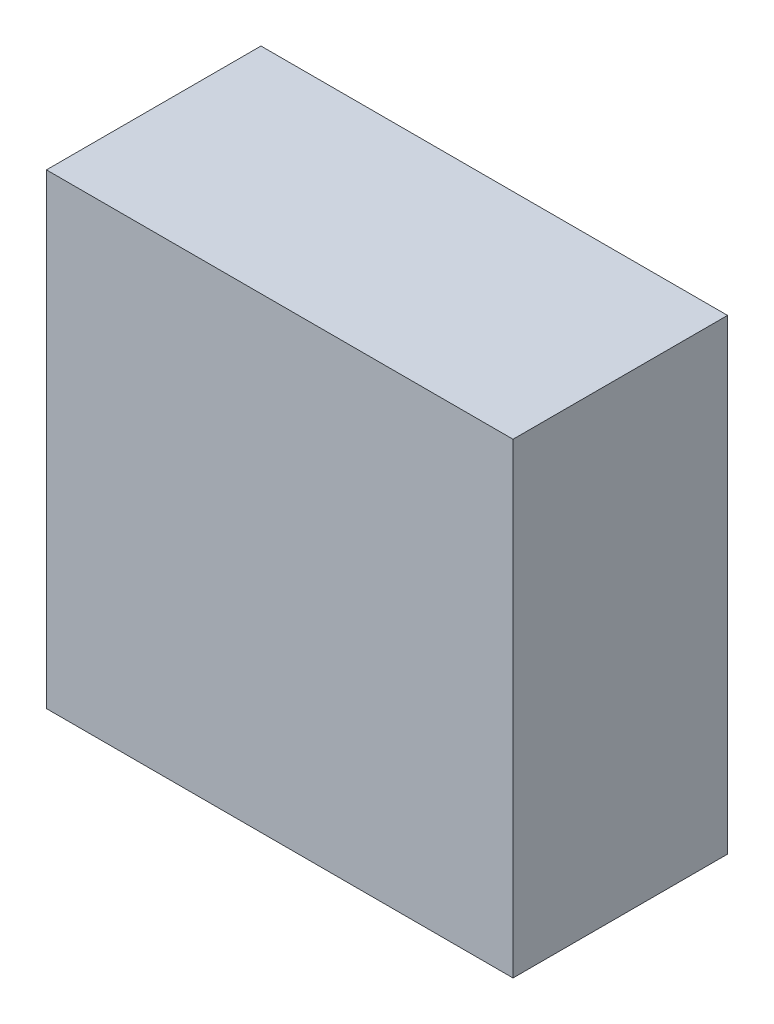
ISO-10303-21;
HEADER;
FILE_DESCRIPTION(('STEP AP214'),'2;1');
FILE_NAME('part.step','',(''),(''),'','','');
FILE_SCHEMA(('AUTOMOTIVE_DESIGN { 1 0 10303 214 1 1 1 1 }'));
ENDSEC;
DATA;
#1=APPLICATION_CONTEXT('core data for automotive mechanical design processes');
#2=APPLICATION_PROTOCOL_DEFINITION('international standard','automotive_design',2000,#1);
#3=PRODUCT_CONTEXT('',#1,'mechanical');
#4=PRODUCT('Part','Part','',(#3));
#5=PRODUCT_RELATED_PRODUCT_CATEGORY('part','',(#4));
#6=PRODUCT_DEFINITION_FORMATION('','',#4);
#7=PRODUCT_DEFINITION_CONTEXT('part definition',#1,'design');
#8=PRODUCT_DEFINITION('design','',#6,#7);
#9=PRODUCT_DEFINITION_SHAPE('','',#8);
#10=(LENGTH_UNIT() NAMED_UNIT(*) SI_UNIT(.MILLI.,.METRE.));
#11=(NAMED_UNIT(*) PLANE_ANGLE_UNIT() SI_UNIT($,.RADIAN.));
#12=(NAMED_UNIT(*) SI_UNIT($,.STERADIAN.) SOLID_ANGLE_UNIT());
#13=UNCERTAINTY_MEASURE_WITH_UNIT(LENGTH_MEASURE(1.E-05),#10,'distance_accuracy_value','');
#14=(GEOMETRIC_REPRESENTATION_CONTEXT(3) GLOBAL_UNCERTAINTY_ASSIGNED_CONTEXT((#13)) GLOBAL_UNIT_ASSIGNED_CONTEXT((#10,
#11,#12)) REPRESENTATION_CONTEXT('',''));
#15=CARTESIAN_POINT('',(0.,0.,0.));
#16=DIRECTION('',(0.,0.,1.));
#17=DIRECTION('',(1.,0.,0.));
#18=AXIS2_PLACEMENT_3D('',#15,#16,#17);
#19=CARTESIAN_POINT('',(-4.34999892,-4.34999892,4.));
#20=DIRECTION('',(0.,0.,1.));
#21=DIRECTION('',(1.,0.,0.));
#22=AXIS2_PLACEMENT_3D('',#19,#20,#21);
#23=PLANE('',#22);
#24=DIRECTION('',(1.,0.,0.));
#25=VECTOR('',#24,1.);
#26=CARTESIAN_POINT('',(-4.34999892,4.35000146,4.));
#27=LINE('',#26,#25);
#28=CARTESIAN_POINT('',(-4.34999892,4.35000146,4.));
#29=VERTEX_POINT('',#28);
#30=CARTESIAN_POINT('',(4.35000146,4.35000146,4.));
#31=VERTEX_POINT('',#30);
#32=EDGE_CURVE('E53',#29,#31,#27,.T.);
#33=ORIENTED_EDGE('',*,*,#32,.F.);
#34=DIRECTION('',(0.,1.,0.));
#35=VECTOR('',#34,1.);
#36=CARTESIAN_POINT('',(-4.34999892,-4.34999892,4.));
#37=LINE('',#36,#35);
#38=CARTESIAN_POINT('',(-4.34999892,-4.34999892,4.));
#39=VERTEX_POINT('',#38);
#40=EDGE_CURVE('E68',#39,#29,#37,.T.);
#41=ORIENTED_EDGE('',*,*,#40,.F.);
#42=DIRECTION('',(1.,0.,0.));
#43=VECTOR('',#42,1.);
#44=CARTESIAN_POINT('',(4.35000146,-4.34999892,4.));
#45=LINE('',#44,#43);
#46=CARTESIAN_POINT('',(4.35000146,-4.34999892,4.));
#47=VERTEX_POINT('',#46);
#48=EDGE_CURVE('E20',#47,#39,#45,.F.);
#49=ORIENTED_EDGE('',*,*,#48,.F.);
#50=DIRECTION('',(0.,1.,0.));
#51=VECTOR('',#50,1.);
#52=CARTESIAN_POINT('',(4.35000146,4.35000146,4.));
#53=LINE('',#52,#51);
#54=EDGE_CURVE('E58',#31,#47,#53,.F.);
#55=ORIENTED_EDGE('',*,*,#54,.F.);
#56=EDGE_LOOP('',(#33,#41,#49,#55));
#57=FACE_BOUND('',#56,.T.);
#58=ADVANCED_FACE('F17',(#57),#23,.T.);
#59=CARTESIAN_POINT('',(4.35000146,-4.34999892,0.));
#60=DIRECTION('',(0.,-1.,0.));
#61=DIRECTION('',(0.,0.,-1.));
#62=AXIS2_PLACEMENT_3D('',#59,#60,#61);
#63=PLANE('',#62);
#64=DIRECTION('',(0.,0.,1.));
#65=VECTOR('',#64,1.);
#66=CARTESIAN_POINT('',(-4.34999892,-4.34999892,0.));
#67=LINE('',#66,#65);
#68=CARTESIAN_POINT('',(-4.34999892,-4.34999892,0.));
#69=VERTEX_POINT('',#68);
#70=EDGE_CURVE('E79',#69,#39,#67,.T.);
#71=ORIENTED_EDGE('',*,*,#70,.F.);
#72=DIRECTION('',(1.,0.,0.));
#73=VECTOR('',#72,1.);
#74=CARTESIAN_POINT('',(-4.34999892,-4.34999892,0.));
#75=LINE('',#74,#73);
#76=CARTESIAN_POINT('',(4.35000146,-4.34999892,0.));
#77=VERTEX_POINT('',#76);
#78=EDGE_CURVE('E74',#69,#77,#75,.T.);
#79=ORIENTED_EDGE('',*,*,#78,.T.);
#80=DIRECTION('',(0.,0.,-1.));
#81=VECTOR('',#80,1.);
#82=CARTESIAN_POINT('',(4.35000146,-4.34999892,0.));
#83=LINE('',#82,#81);
#84=EDGE_CURVE('E63',#47,#77,#83,.T.);
#85=ORIENTED_EDGE('',*,*,#84,.F.);
#86=ORIENTED_EDGE('',*,*,#48,.T.);
#87=EDGE_LOOP('',(#71,#79,#85,#86));
#88=FACE_BOUND('',#87,.T.);
#89=ADVANCED_FACE('F73',(#88),#63,.T.);
#90=CARTESIAN_POINT('',(4.35000146,4.35000146,0.));
#91=DIRECTION('',(1.,0.,0.));
#92=DIRECTION('',(0.,0.,-1.));
#93=AXIS2_PLACEMENT_3D('',#90,#91,#92);
#94=PLANE('',#93);
#95=ORIENTED_EDGE('',*,*,#84,.T.);
#96=DIRECTION('',(0.,1.,0.));
#97=VECTOR('',#96,1.);
#98=CARTESIAN_POINT('',(4.35000146,-4.34999892,0.));
#99=LINE('',#98,#97);
#100=CARTESIAN_POINT('',(4.35000146,4.35000146,0.));
#101=VERTEX_POINT('',#100);
#102=EDGE_CURVE('E84',#77,#101,#99,.T.);
#103=ORIENTED_EDGE('',*,*,#102,.T.);
#104=DIRECTION('',(0.,0.,1.));
#105=VECTOR('',#104,1.);
#106=CARTESIAN_POINT('',(4.35000146,4.35000146,0.));
#107=LINE('',#106,#105);
#108=EDGE_CURVE('E65',#31,#101,#107,.F.);
#109=ORIENTED_EDGE('',*,*,#108,.F.);
#110=ORIENTED_EDGE('',*,*,#54,.T.);
#111=EDGE_LOOP('',(#95,#103,#109,#110));
#112=FACE_BOUND('',#111,.T.);
#113=ADVANCED_FACE('F60',(#112),#94,.T.);
#114=CARTESIAN_POINT('',(-4.34999892,4.35000146,0.));
#115=DIRECTION('',(0.,1.,0.));
#116=DIRECTION('',(0.,0.,1.));
#117=AXIS2_PLACEMENT_3D('',#114,#115,#116);
#118=PLANE('',#117);
#119=ORIENTED_EDGE('',*,*,#108,.T.);
#120=DIRECTION('',(1.,0.,0.));
#121=VECTOR('',#120,1.);
#122=CARTESIAN_POINT('',(-4.34999892,4.35000146,0.));
#123=LINE('',#122,#121);
#124=CARTESIAN_POINT('',(-4.34999892,4.35000146,0.));
#125=VERTEX_POINT('',#124);
#126=EDGE_CURVE('E26',#101,#125,#123,.F.);
#127=ORIENTED_EDGE('',*,*,#126,.T.);
#128=DIRECTION('',(0.,0.,1.));
#129=VECTOR('',#128,1.);
#130=CARTESIAN_POINT('',(-4.34999892,4.35000146,0.));
#131=LINE('',#130,#129);
#132=EDGE_CURVE('E34',#29,#125,#131,.F.);
#133=ORIENTED_EDGE('',*,*,#132,.F.);
#134=ORIENTED_EDGE('',*,*,#32,.T.);
#135=EDGE_LOOP('',(#119,#127,#133,#134));
#136=FACE_BOUND('',#135,.T.);
#137=ADVANCED_FACE('F88',(#136),#118,.T.);
#138=CARTESIAN_POINT('',(-4.34999892,-4.34999892,0.));
#139=DIRECTION('',(-1.,0.,0.));
#140=DIRECTION('',(0.,0.,1.));
#141=AXIS2_PLACEMENT_3D('',#138,#139,#140);
#142=PLANE('',#141);
#143=ORIENTED_EDGE('',*,*,#132,.T.);
#144=DIRECTION('',(0.,1.,0.));
#145=VECTOR('',#144,1.);
#146=CARTESIAN_POINT('',(-4.34999892,-4.34999892,0.));
#147=LINE('',#146,#145);
#148=EDGE_CURVE('E11',#125,#69,#147,.F.);
#149=ORIENTED_EDGE('',*,*,#148,.T.);
#150=ORIENTED_EDGE('',*,*,#70,.T.);
#151=ORIENTED_EDGE('',*,*,#40,.T.);
#152=EDGE_LOOP('',(#143,#149,#150,#151));
#153=FACE_BOUND('',#152,.T.);
#154=ADVANCED_FACE('F91',(#153),#142,.T.);
#155=CARTESIAN_POINT('',(-4.34999892,-4.34999892,0.));
#156=DIRECTION('',(0.,0.,1.));
#157=DIRECTION('',(1.,0.,0.));
#158=AXIS2_PLACEMENT_3D('',#155,#156,#157);
#159=PLANE('',#158);
#160=ORIENTED_EDGE('',*,*,#126,.F.);
#161=ORIENTED_EDGE('',*,*,#102,.F.);
#162=ORIENTED_EDGE('',*,*,#78,.F.);
#163=ORIENTED_EDGE('',*,*,#148,.F.);
#164=EDGE_LOOP('',(#160,#161,#162,#163));
#165=FACE_BOUND('',#164,.T.);
#166=ADVANCED_FACE('F90',(#165),#159,.F.);
#167=CLOSED_SHELL('',(#58,#89,#113,#137,#154,#166));
#168=MANIFOLD_SOLID_BREP('B1',#167);
#169=ADVANCED_BREP_SHAPE_REPRESENTATION('',(#18,#168),#14);
#170=SHAPE_DEFINITION_REPRESENTATION(#9,#169);
ENDSEC;
END-ISO-10303-21;
